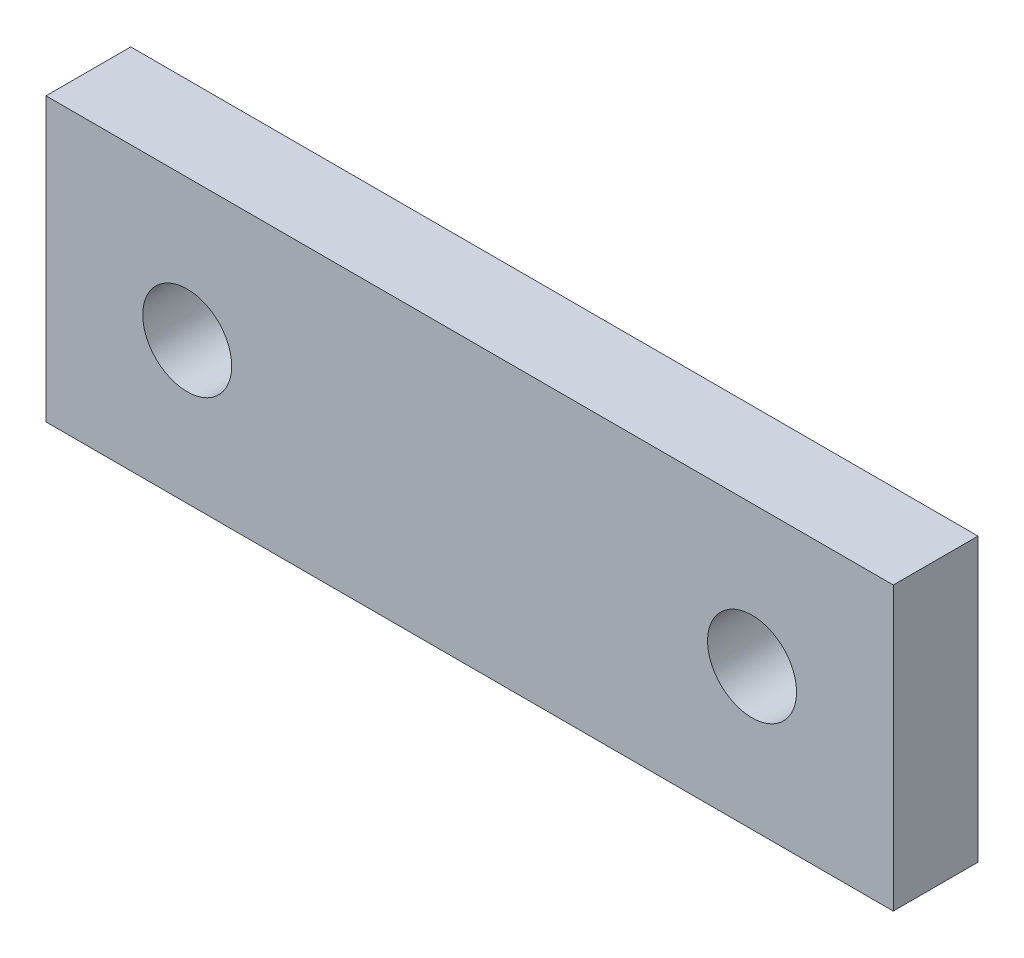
from build123d import *

# Parameters (mm, degrees)
SKETCH1_W           = 76.2
SKETCH1_H           = 25.4
BOSS_EXTRUDE1_DEPTH = 7.62
SKETCH2_R           = 4
CUT_EXTRUDE1_DEPTH  = 41.877431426


with BuildPart() as part:
    # Sketch1 → Boss-Extrude1 (new body)
    with BuildSketch(Plane.XY):
        Rectangle(SKETCH1_W, SKETCH1_H)
    extrude(amount=BOSS_EXTRUDE1_DEPTH)

    # Sketch2 → Cut-Extrude1 (cut, through all)
    with BuildSketch(Plane.XY.offset(7.62)):
        with Locations((-25.4, 0)):
            Circle(SKETCH2_R)
    cut_extrude1 = extrude(amount=-CUT_EXTRUDE1_DEPTH, mode=Mode.SUBTRACT)

    # Mirror1: Cut-Extrude1 across plane
    add(cut_extrude1.mirror(Plane(origin=(0, 0, 0), x_dir=(0, 0, 1), z_dir=(1, 0, 0))), mode=Mode.SUBTRACT)


solid = part.part
